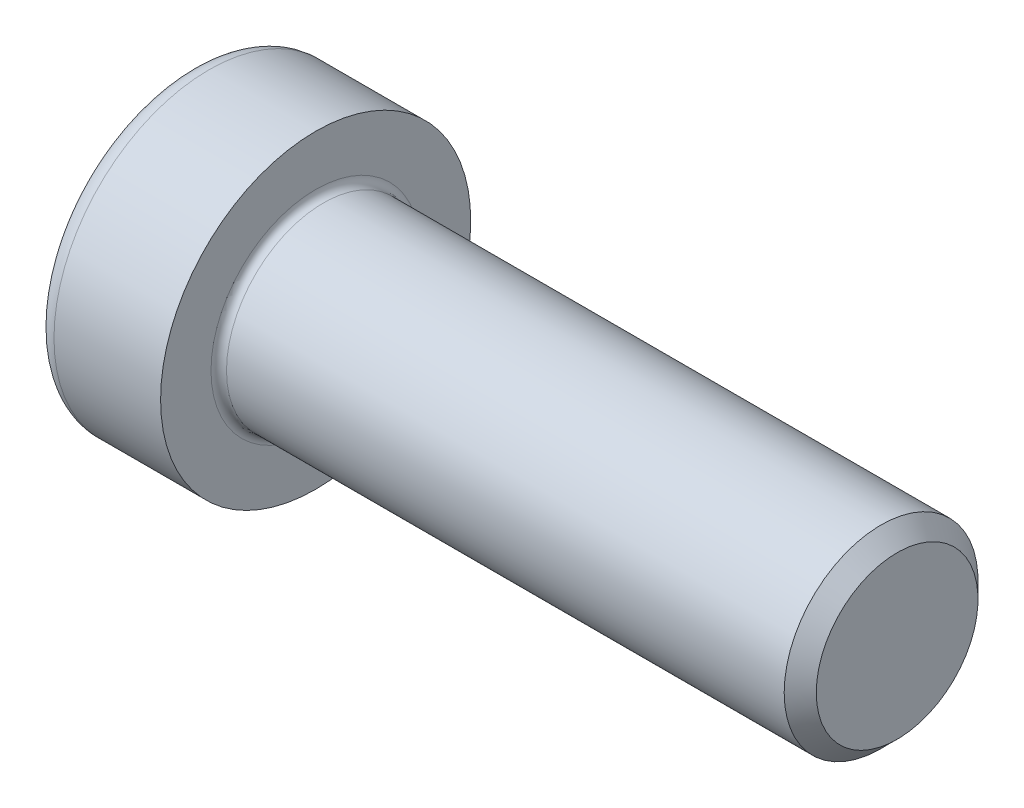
from build123d import *

# Parameters (mm, degrees)
FILLET1_R   = 0.4
FILLET2_R   = 1
HEX_2_DEPTH = 3.65


with BuildPart() as part:
    # BodySke → Base-Revolve (revolve)
    with BuildSketch(Plane.XY, mode=Mode.PRIVATE) as base_revolve_sk:
        Polygon((0, 0), (0, 8), (6.5, 8), (6.5, 5), (35.672, 5), (36.5, 4.172), (36.5, 0), align=None)
    revolve(base_revolve_sk.sketch.rotate(Axis((-31.75, 0, 0), (1, 0, 0)), 90), axis=Axis((-31.75, 0, 0), (1, 0, 0)))

    # Fillet1
    fillet1_edges = [part.edges().sort_by_distance(p)[0] for p in [
        (6.5, 0, -5),
    ]]
    fillet(fillet1_edges, radius=FILLET1_R)

    # Fillet2
    fillet2_edges = [part.edges().sort_by_distance(p)[0] for p in [
        (0, 0, -8),
    ]]
    fillet(fillet2_edges, radius=FILLET2_R)

    # HexSke → Hex 2 (cut)
    with BuildSketch(Plane(origin=(0, 0, 0), x_dir=(0, 0.500000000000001, 0.866025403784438), z_dir=(-1, 0, 0))):
        Polygon((2.359919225, 4.0875), (-2.359919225, 4.0875), (-4.719838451, 0), (-2.359919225, -4.0875), (2.359919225, -4.0875), (4.719838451, 0), align=None)
    extrude(amount=-HEX_2_DEPTH, mode=Mode.SUBTRACT)

    # PilotSke → Hex-PreBroach (revolve, cut)
    with BuildSketch(Plane.XY, mode=Mode.PRIVATE) as hex_prebroach_sk:
        Polygon((0, 4.0875), (3.65, 4.0875), (4.544892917, 2.5375), (7.86, 2.5375), (9.325026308, 0), (0, 0), align=None)
    revolve(hex_prebroach_sk.sketch.rotate(Axis((0, 0, 0), (1, 0, 0)), 90), axis=Axis((0, 0, 0), (1, 0, 0)), mode=Mode.SUBTRACT)


solid = part.part
